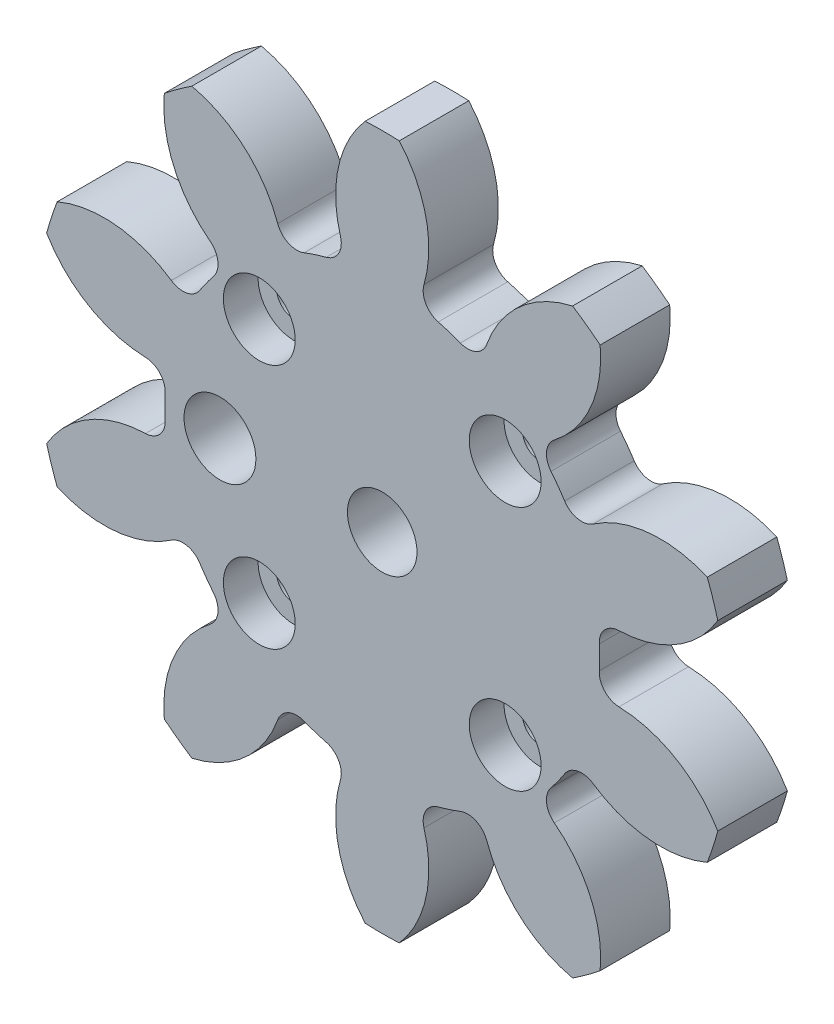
from build123d import *

# Parameters (mm, degrees)
BOSS_EXTRU_1_DEPTH                 = 6
CONG_1_R                           = 1.75
R_P_TITION_CIRCULAIRE4_COUNT       = 10
CONG_1_OF_R_P_TITION_CIRCULAIRE4_R = 1.75
ESQUISSE6_R                        = 3
ENL_V_MAT_EXTRU_1_DEPTH            = 10
ESQUISSE8_R                        = 1.5
ESQUISSE8_R_2                      = 3.1
ENL_V_MAT_EXTRU_3_DEPTH            = 43.121013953
ESQUISSE9_R                        = 3.1
ENL_V_MAT_EXTRU_4_DEPTH            = 3


with BuildPart() as part:
    # Esquisse3 → Boss.-Extru.1 (new body)
    with BuildSketch(Plane.XY):
        with BuildLine():
            Line((-5.794068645, 17.832309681), (0, 0))
            Line((0, 0), (5.794068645, 17.832309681))
            ThreePointArc((5.794068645, 17.832309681), (4.357814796, 18.236555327), (2.893965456, 18.525319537))
            ThreePointArc((2.893965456, 18.525319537), (3.941898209, 24.464041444), (1.468694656, 29.964027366))
            ThreePointArc((1.468694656, 29.964027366), (0, 30), (-1.468694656, 29.964027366))
            ThreePointArc((-1.468694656, 29.964027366), (-3.941898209, 24.464041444), (-2.893965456, 18.525319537))
            ThreePointArc((-2.893965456, 18.525319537), (-4.357814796, 18.236555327), (-5.794068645, 17.832309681))
        make_face()
    boss_extru_1 = extrude(amount=BOSS_EXTRU_1_DEPTH)

    # Cong_1
    cong_1_edges = [part.edges().sort_by_distance(p)[0] for p in [
        (-2.893965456, 18.525319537, 3),
        (2.893965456, 18.525319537, 3),
    ]]
    fillet(cong_1_edges, radius=CONG_1_R)

    # R_p_tition circulaire4: Boss.-Extru.1 ×10 about axis
    r_p_tition_circulaire4_axis = Axis((0, 0, 0), (0, 0, 1))
    for i in range(1, R_P_TITION_CIRCULAIRE4_COUNT):
        add(boss_extru_1.rotate(r_p_tition_circulaire4_axis, i * 360 / R_P_TITION_CIRCULAIRE4_COUNT))

    # Cong_1 of R_p_tition circulaire4
    cong_1_of_r_p_tition_circulaire4_edges = [part.edges().sort_by_distance(p)[0] for p in [
        (-13.230176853, 13.286268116, 3),
        (-8.547642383, 16.688328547, 3),
        (-18.512910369, 2.972313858, 3),
        (-16.724341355, 8.476963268, 3),
        (-16.724341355, -8.476963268, 3),
        (-18.512910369, -2.972313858, 3),
        (-8.547642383, -16.688328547, 3),
        (-13.230176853, -13.286268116, 3),
        (2.893965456, -18.525319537, 3),
        (-2.893965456, -18.525319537, 3),
        (13.230176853, -13.286268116, 3),
        (8.547642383, -16.688328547, 3),
        (18.512910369, -2.972313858, 3),
        (16.724341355, -8.476963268, 3),
        (16.724341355, 8.476963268, 3),
        (18.512910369, 2.972313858, 3),
        (8.547642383, 16.688328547, 3),
        (13.230176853, 13.286268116, 3),
    ]]
    fillet(cong_1_of_r_p_tition_circulaire4_edges, radius=CONG_1_OF_R_P_TITION_CIRCULAIRE4_R)

    # Esquisse6 → Enl_v. mat.-Extru.1 (cut)
    with BuildSketch(Plane.XY.offset(6)):
        Circle(ESQUISSE6_R)
    extrude(amount=-ENL_V_MAT_EXTRU_1_DEPTH, mode=Mode.SUBTRACT)

    # Esquisse8 → Enl_v. mat.-Extru.3 (cut, through all)
    with BuildSketch(Plane.XY.offset(6)):
        with Locations((-10.606601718, 10.606601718)):
            Circle(ESQUISSE8_R)
        with Locations((10.606601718, -10.606601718)):
            Circle(ESQUISSE8_R)
        with Locations((-10.606601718, -10.606601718)):
            Circle(ESQUISSE8_R)
        with Locations(Location((10.606601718, 10.606601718, 0), (0, 0, 180))):
            Circle(ESQUISSE8_R)
        with Locations((-14, 0)):
            Circle(ESQUISSE8_R_2)
    extrude(amount=-ENL_V_MAT_EXTRU_3_DEPTH, mode=Mode.SUBTRACT)

    # Esquisse9 → Enl_v. mat.-Extru.4 (cut)
    with BuildSketch(Plane.XY.offset(6)):
        with Locations((-10.606601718, 10.606601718)):
            Circle(ESQUISSE9_R)
        with Locations((-10.606601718, -10.606601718)):
            Circle(ESQUISSE9_R)
        with Locations((10.606601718, -10.606601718)):
            Circle(ESQUISSE9_R)
        with Locations((10.606601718, 10.606601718)):
            Circle(ESQUISSE9_R)
    extrude(amount=-ENL_V_MAT_EXTRU_4_DEPTH, mode=Mode.SUBTRACT)


solid = part.part
